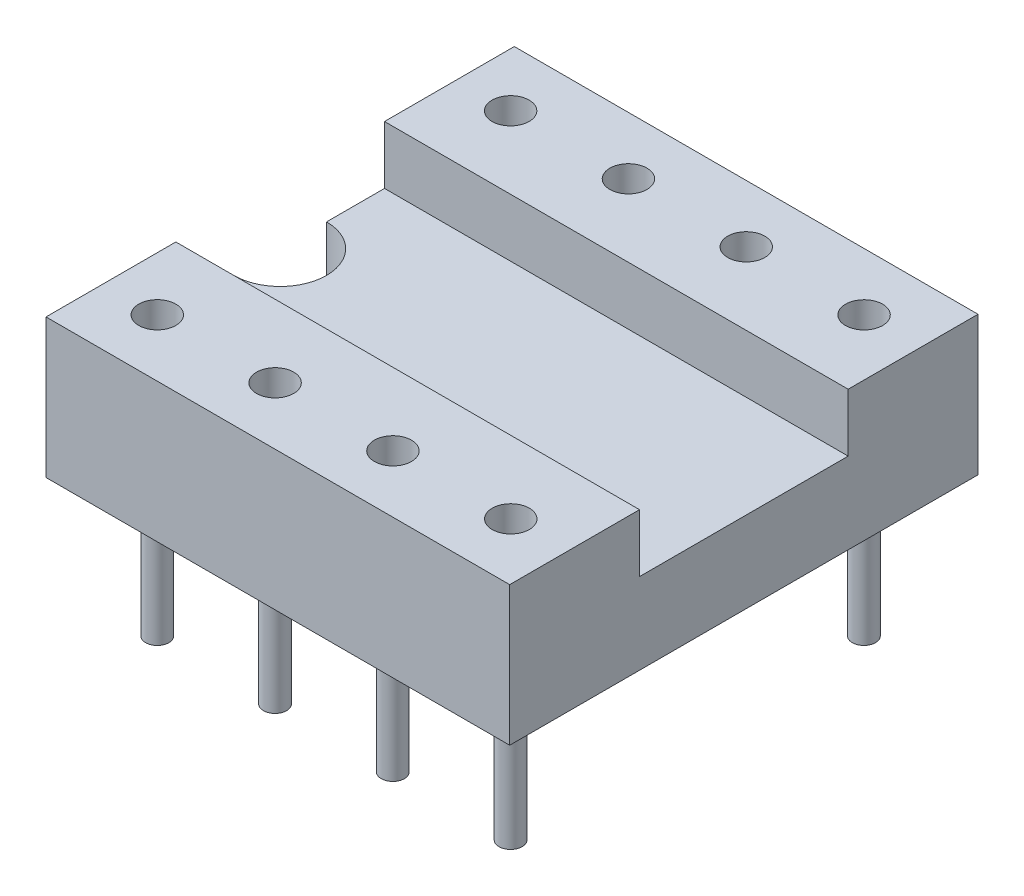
from build123d import *

# Parameters (mm, degrees)
EXTRUSION1_DEPTH        = 10
ENL_V_MAT_EXTRU_1_DEPTH = 12.338650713
ESQUISSE3_R             = 0.4
ENL_V_MAT_EXTRU_2_DEPTH = 2.5
ESQUISSE5_R             = 0.25
EXTRUSION2_DEPTH        = 3


with BuildPart() as part:
    # Esquisse1 → Extrusion1 (new body)
    with BuildSketch(Plane(origin=(0, 0, 0), x_dir=(0, 0, -1), z_dir=(1, 0, 0))):
        Polygon((-2.25, 1.75), (-2.25, 3), (-5.05, 3), (-5.05, 0), (5.05, 0), (5.05, 3), (2.25, 3), (2.25, 1.75), align=None)
    extrude(amount=EXTRUSION1_DEPTH)

    # Esquisse2 → Enl_v. mat.-Extru.1 (cut, through all)
    with BuildSketch(Plane(origin=(0, 1.75, 0), x_dir=(-1, 0, 0), z_dir=(0, 1, 0))):
        with BuildLine():
            Line((0, -1), (0, 1))
            ThreePointArc((0, 1), (-1, 0), (0, -1))
        make_face()
    extrude(amount=-ENL_V_MAT_EXTRU_1_DEPTH, mode=Mode.SUBTRACT)

    # Esquisse3 → Enl_v. mat.-Extru.2 (cut)
    with BuildSketch(Plane(origin=(0, 3, 0), x_dir=(-1, 0, 0), z_dir=(0, 1, 0))):
        with Locations(Location((-1.16, 3.81, 0), (0, 0, 90))):
            Circle(ESQUISSE3_R)
        with Locations(Location((-1.16, -3.81, 0), (0, 0, 270))):
            Circle(ESQUISSE3_R)
        with Locations(Location((-3.701, 3.81, 0), (0, 0, 90))):
            Circle(ESQUISSE3_R)
        with Locations(Location((-3.701, -3.81, 0), (0, 0, 270))):
            Circle(ESQUISSE3_R)
        with Locations(Location((-6.242, 3.81, 0), (0, 0, 90))):
            Circle(ESQUISSE3_R)
        with Locations(Location((-6.242, -3.81, 0), (0, 0, 270))):
            Circle(ESQUISSE3_R)
        with Locations(Location((-8.783, 3.81, 0), (0, 0, 90))):
            Circle(ESQUISSE3_R)
        with Locations(Location((-8.783, -3.81, 0), (0, 0, 270))):
            Circle(ESQUISSE3_R)
    extrude(amount=-ENL_V_MAT_EXTRU_2_DEPTH, mode=Mode.SUBTRACT)

    # Esquisse5 → Extrusion2 (add)
    with BuildSketch(Plane.XZ):
        with Locations(Location((1.16, 3.81, 0), (0, 0, 90))):
            Circle(ESQUISSE5_R)
        with Locations(Location((1.16, -3.81, 0), (0, 0, 90))):
            Circle(ESQUISSE5_R)
        with Locations(Location((3.7, -3.81, 0), (0, 0, 90))):
            Circle(ESQUISSE5_R)
        with Locations(Location((3.7, 3.81, 0), (0, 0, 90))):
            Circle(ESQUISSE5_R)
        with Locations(Location((6.24, -3.81, 0), (0, 0, 90))):
            Circle(ESQUISSE5_R)
        with Locations(Location((6.24, 3.81, 0), (0, 0, 90))):
            Circle(ESQUISSE5_R)
        with Locations(Location((8.78, -3.81, 0), (0, 0, 90))):
            Circle(ESQUISSE5_R)
        with Locations(Location((8.78, 3.81, 0), (0, 0, 90))):
            Circle(ESQUISSE5_R)
    extrude(amount=EXTRUSION2_DEPTH)


solid = part.part
